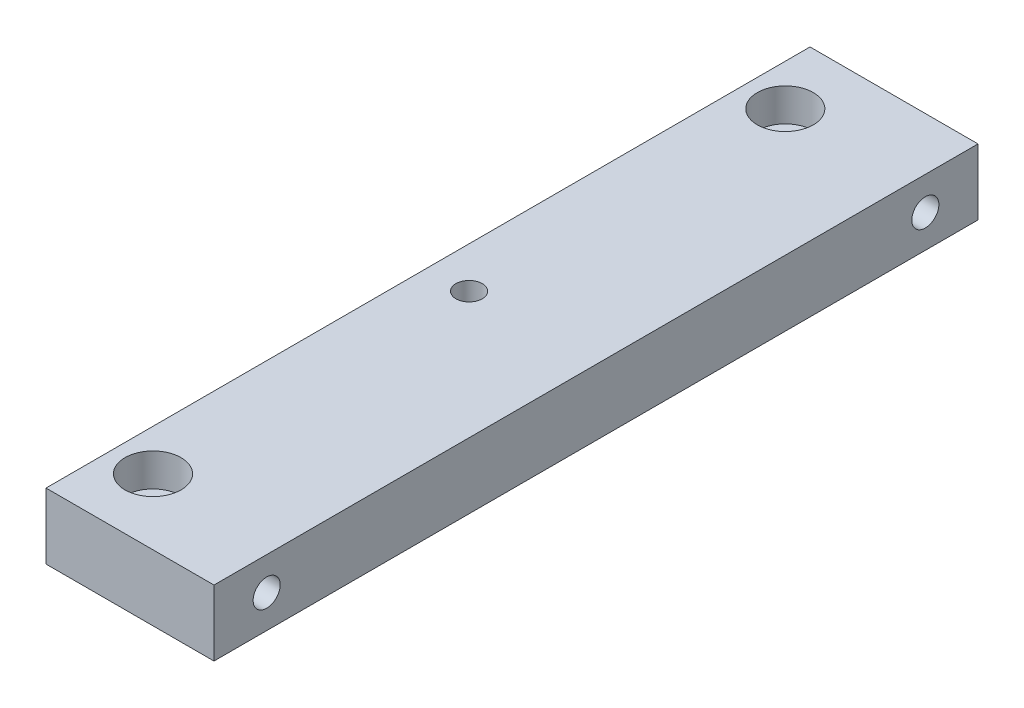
from build123d import *

# Parameters (mm, degrees)
SKETCH1_W                                        = 40.4876
SKETCH1_H                                        = 184.15
BOSS_EXTRUDE1_DEPTH                              = 7.9375
CBORE_FOR_1_4_SOCKET_HEAD_CAP_SCREW1_D           = 8.4328
CBORE_FOR_1_4_SOCKET_HEAD_CAP_SCREW1_CBORE_D     = 13.49502
CBORE_FOR_1_4_SOCKET_HEAD_CAP_SCREW1_CBORE_DEPTH = 7.9375
F_1_4_0_2500_DOWEL_HOLE1_D                       = 6.35
F_5_16_18_TAPPED_HOLE1_D                         = 6.5278
F_5_16_18_TAPPED_HOLE1_DEPTH                     = 20.32
F_5_16_18_TAPPED_HOLE1_TIP                       = 1.961148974


with BuildPart() as part:
    # Sketch1 → Boss-Extrude1 (new, symmetric)
    with BuildSketch(Plane(origin=(0, 0, 0), x_dir=(1, 0, 0), z_dir=(0, 1, 0))):
        Rectangle(SKETCH1_W, SKETCH1_H)
    extrude(amount=BOSS_EXTRUDE1_DEPTH, both=True)

    # CBORE for 1_4 Socket Head Cap Screw1 (through all)
    with Locations(Plane(origin=(0, 7.9375, 0), x_dir=(1, 0, 0), z_dir=(0, 1, 0))):
        with Locations((-10.32350742, -76.2), (-10.32350742, 76.2)):
            CounterBoreHole(CBORE_FOR_1_4_SOCKET_HEAD_CAP_SCREW1_D / 2, CBORE_FOR_1_4_SOCKET_HEAD_CAP_SCREW1_CBORE_D / 2, CBORE_FOR_1_4_SOCKET_HEAD_CAP_SCREW1_CBORE_DEPTH)

    # 1_4 _0.2500_ Dowel Hole1 (through all)
    with Locations(Plane(origin=(0, -7.9375, 0), x_dir=(-1, 0, 0), z_dir=(0, -1, 0))):
        with Locations((10.33620742, 0)):
            Hole(F_1_4_0_2500_DOWEL_HOLE1_D / 2)

    # 5_16-18 Tapped Hole1
    with Locations(Plane(origin=(20.2438, 0, 0), x_dir=(0, 0, -1), z_dir=(1, 0, 0))):
        with Locations((79.375, 0), (-79.375, 0)):
            Hole(F_5_16_18_TAPPED_HOLE1_D / 2, depth=F_5_16_18_TAPPED_HOLE1_DEPTH)
            with Locations((0, 0, -(F_5_16_18_TAPPED_HOLE1_DEPTH + F_5_16_18_TAPPED_HOLE1_TIP / 2))):  # 118° drill point
                Cone(0, F_5_16_18_TAPPED_HOLE1_D / 2, F_5_16_18_TAPPED_HOLE1_TIP, mode=Mode.SUBTRACT)


solid = part.part
